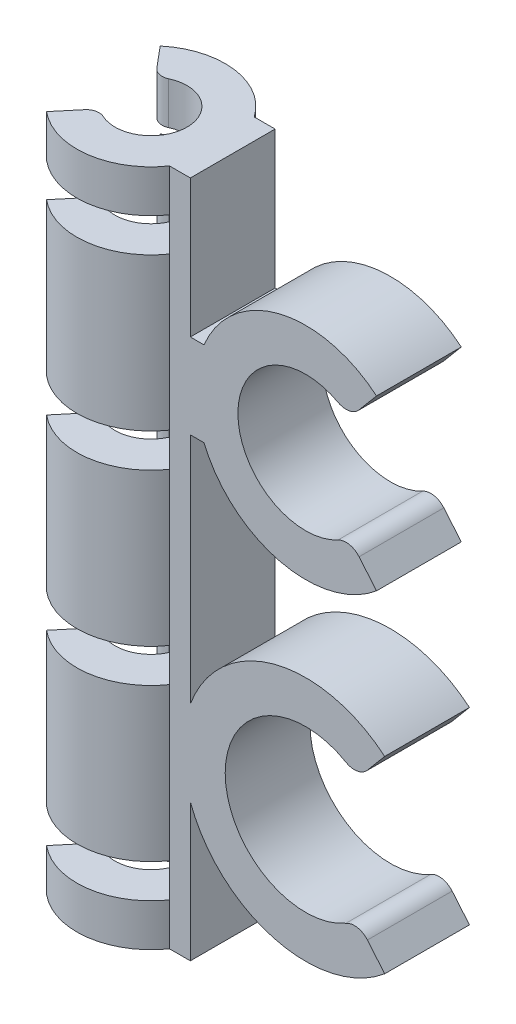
from build123d import *

# Parameters (mm, degrees)
BOSS_EXTRUDE1_DEPTH     = 40
BOSS_EXTRUDE2_DEPTH     = 5
CUT_EXTRUDE1_DEPTH      = 53.320118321
CUT_EXTRUDE1_DEPTH_BACK = 53.320118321
SKETCH5_W               = 13
SKETCH5_H               = 4
FILLET1_R               = 2
FILLET2_R               = 1.5
BOSS_EXTRUDE3_START     = -80
BOSS_EXTRUDE3_DEPTH     = 80


with BuildPart() as part:
    # Sketch1 → Boss-Extrude1 (new, symmetric)
    with BuildSketch(Plane(origin=(0, 0, 0), x_dir=(1, 0, 0), z_dir=(0, 1, 0))):
        with BuildLine():
            Line((-2.731847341, 3.255688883), (-5.624391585, 6.702888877))
            ThreePointArc((-5.624391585, 6.702888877), (8.75, 0), (-5.624391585, -6.702888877))
            Line((-5.624391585, -6.702888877), (-2.731847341, -3.255688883))
            ThreePointArc((-2.731847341, -3.255688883), (4.25, 0), (-2.731847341, 3.255688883))
        make_face()
    extrude(amount=BOSS_EXTRUDE1_DEPTH, both=True)

    # Sketch2 → Boss-Extrude2 (add, symmetric)
    with BuildSketch(Plane.XY):
        with BuildLine():
            ThreePointArc((11.25, 13.75), (10.25, 18.75), (11.25, 23.75))
            Line((11.25, 23.75), (4.25, 23.75))
            Line((4.25, 23.75), (4.25, 13.75))
            Line((4.25, 13.75), (11.25, 13.75))
        make_face()
        with BuildLine():
            Line((31.606238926, 28.708577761), (28.392300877, 24.878355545))
            ThreePointArc((28.392300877, 24.878355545), (15.25, 18.75), (28.392300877, 12.621644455))
            Line((28.392300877, 12.621644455), (31.606238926, 8.791422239))
            ThreePointArc((31.606238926, 8.791422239), (10.25, 18.75), (31.606238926, 28.708577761))
        make_face()
        with BuildLine():
            Line((4.25, -23.75), (9.639342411, -23.75))
            ThreePointArc((9.639342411, -23.75), (8.75, -18.75), (9.639342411, -13.75))
            Line((9.639342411, -13.75), (4.25, -13.75))
            Line((4.25, -13.75), (4.25, -23.75))
        make_face()
        with BuildLine():
            Line((32.57042034, -7.642355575), (29.356482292, -11.47257779))
            ThreePointArc((29.356482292, -11.47257779), (13.75, -18.75), (29.356482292, -26.02742221))
            Line((29.356482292, -26.02742221), (32.57042034, -29.857644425))
            ThreePointArc((32.57042034, -29.857644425), (8.75, -18.75), (32.57042034, -7.642355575))
        make_face()
    extrude(amount=BOSS_EXTRUDE2_DEPTH, both=True)

    # Sketch5 → Cut-Extrude1 (cut, two sides: drawn at the far end of the back side and taken through both)
    with BuildSketch(Plane.XY.offset(-CUT_EXTRUDE1_DEPTH_BACK)):
        with Locations((0.875608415, 33)):
            Rectangle(SKETCH5_W, SKETCH5_H)
        with Locations((0.875608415, 11)):
            Rectangle(SKETCH5_W, SKETCH5_H)
        with Locations((0.875608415, -11)):
            Rectangle(SKETCH5_W, SKETCH5_H)
        with Locations((0.875608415, -33)):
            Rectangle(SKETCH5_W, SKETCH5_H)
    extrude(amount=CUT_EXTRUDE1_DEPTH + CUT_EXTRUDE1_DEPTH_BACK, mode=Mode.SUBTRACT)

    # Fillet1
    fillet1_edges = [part.edges().sort_by_distance(p)[0] for p in [
        (28.392300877, 12.621644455, 0),
        (28.392300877, 24.878355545, 0),
        (29.356482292, -26.02742221, 0),
        (29.356482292, -11.47257779, 0),
    ]]
    fillet(fillet1_edges, radius=FILLET1_R)

    # Fillet2
    fillet2_edges = [part.edges().sort_by_distance(p)[0] for p in [
        (-2.731847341, 22, 3.255688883),
        (-2.731847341, 0, 3.255688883),
        (-2.731847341, -22, 3.255688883),
        (-2.731847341, -37.5, 3.255688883),
        (-2.731847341, 22, -3.255688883),
        (-2.731847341, 0, -3.255688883),
        (-2.731847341, -22, -3.255688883),
        (-2.731847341, -37.5, -3.255688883),
        (-2.731847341, 37.5, -3.255688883),
        (-2.731847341, 37.5, 3.255688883),
    ]]
    fillet(fillet2_edges, radius=FILLET2_R)

    # Sketch6 → Boss-Extrude3 (add)
    with BuildSketch(Plane.XZ.offset(40).offset(BOSS_EXTRUDE3_START)):
        with BuildLine():
            Line((9.639342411, 5), (7.180703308, 5))
            ThreePointArc((7.180703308, 5), (8.75, 0), (7.180703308, -5))
            Line((7.180703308, -5), (9.639342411, -5))
            Line((9.639342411, -5), (9.639342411, 5))
        make_face()
    extrude(amount=BOSS_EXTRUDE3_DEPTH)


solid = part.part
